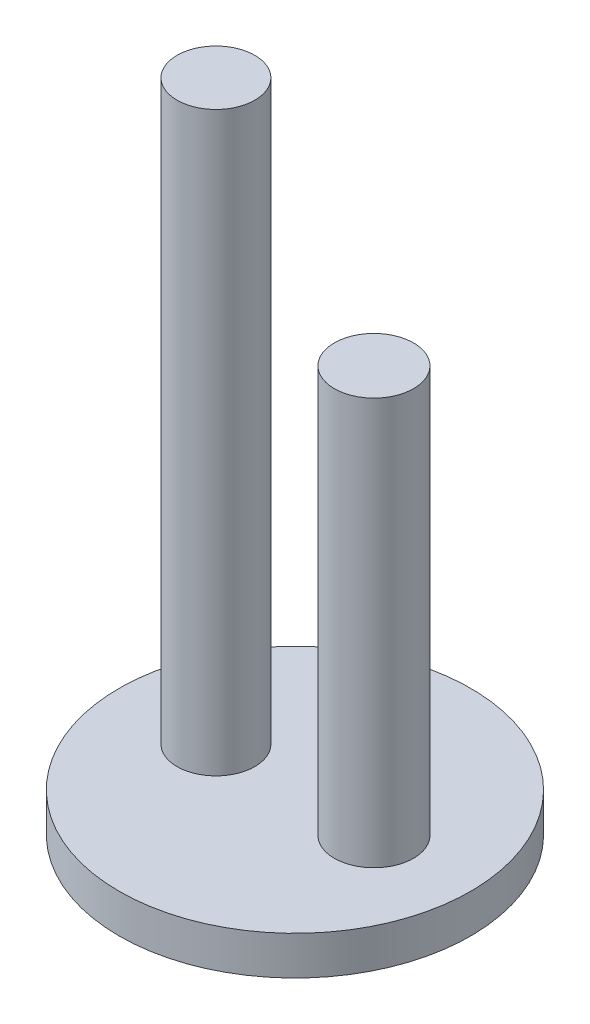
ISO-10303-21;
HEADER;
FILE_DESCRIPTION(('STEP AP214'),'2;1');
FILE_NAME('part.step','',(''),(''),'','','');
FILE_SCHEMA(('AUTOMOTIVE_DESIGN { 1 0 10303 214 1 1 1 1 }'));
ENDSEC;
DATA;
#1=APPLICATION_CONTEXT('core data for automotive mechanical design processes');
#2=APPLICATION_PROTOCOL_DEFINITION('international standard','automotive_design',2000,#1);
#3=PRODUCT_CONTEXT('',#1,'mechanical');
#4=PRODUCT('Part','Part','',(#3));
#5=PRODUCT_RELATED_PRODUCT_CATEGORY('part','',(#4));
#6=PRODUCT_DEFINITION_FORMATION('','',#4);
#7=PRODUCT_DEFINITION_CONTEXT('part definition',#1,'design');
#8=PRODUCT_DEFINITION('design','',#6,#7);
#9=PRODUCT_DEFINITION_SHAPE('','',#8);
#10=(LENGTH_UNIT() NAMED_UNIT(*) SI_UNIT(.MILLI.,.METRE.));
#11=(NAMED_UNIT(*) PLANE_ANGLE_UNIT() SI_UNIT($,.RADIAN.));
#12=(NAMED_UNIT(*) SI_UNIT($,.STERADIAN.) SOLID_ANGLE_UNIT());
#13=UNCERTAINTY_MEASURE_WITH_UNIT(LENGTH_MEASURE(1.E-05),#10,'distance_accuracy_value','');
#14=(GEOMETRIC_REPRESENTATION_CONTEXT(3) GLOBAL_UNCERTAINTY_ASSIGNED_CONTEXT((#13)) GLOBAL_UNIT_ASSIGNED_CONTEXT((#10,
#11,#12)) REPRESENTATION_CONTEXT('',''));
#15=CARTESIAN_POINT('',(0.,0.,0.));
#16=DIRECTION('',(0.,0.,1.));
#17=DIRECTION('',(1.,0.,0.));
#18=AXIS2_PLACEMENT_3D('',#15,#16,#17);
#19=CARTESIAN_POINT('',(0.,2.54,0.));
#20=DIRECTION('',(0.,1.,0.));
#21=DIRECTION('',(0.,0.,1.));
#22=AXIS2_PLACEMENT_3D('',#19,#20,#21);
#23=PLANE('',#22);
#24=CARTESIAN_POINT('',(-5.18043936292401,2.54,0.));
#25=DIRECTION('',(0.,1.,0.));
#26=DIRECTION('',(0.,0.,1.));
#27=AXIS2_PLACEMENT_3D('',#24,#25,#26);
#28=CIRCLE('',#27,2.55008613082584);
#29=CARTESIAN_POINT('',(-5.18043936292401,2.54,2.55008613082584));
#30=VERTEX_POINT('',#29);
#31=EDGE_CURVE('E46',#30,#30,#28,.T.);
#32=ORIENTED_EDGE('',*,*,#31,.F.);
#33=EDGE_LOOP('',(#32));
#34=FACE_BOUND('',#33,.T.);
#35=CARTESIAN_POINT('',(0.,2.54,0.));
#36=DIRECTION('',(0.,1.,0.));
#37=DIRECTION('',(0.,0.,1.));
#38=AXIS2_PLACEMENT_3D('',#35,#36,#37);
#39=CIRCLE('',#38,11.528213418);
#40=CARTESIAN_POINT('',(0.,2.54,11.528213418));
#41=VERTEX_POINT('',#40);
#42=EDGE_CURVE('E10',#41,#41,#39,.T.);
#43=ORIENTED_EDGE('',*,*,#42,.T.);
#44=EDGE_LOOP('',(#43));
#45=FACE_BOUND('',#44,.T.);
#46=CARTESIAN_POINT('',(5.18043936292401,2.54,0.));
#47=DIRECTION('',(0.,1.,0.));
#48=DIRECTION('',(0.,0.,1.));
#49=AXIS2_PLACEMENT_3D('',#46,#47,#48);
#50=CIRCLE('',#49,2.59930909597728);
#51=CARTESIAN_POINT('',(5.18043936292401,2.54,2.59930909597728));
#52=VERTEX_POINT('',#51);
#53=EDGE_CURVE('E52',#52,#52,#50,.T.);
#54=ORIENTED_EDGE('',*,*,#53,.F.);
#55=EDGE_LOOP('',(#54));
#56=FACE_BOUND('',#55,.T.);
#57=ADVANCED_FACE('F33',(#34,#45,#56),#23,.T.);
#58=CARTESIAN_POINT('',(0.,2.54,0.));
#59=DIRECTION('',(0.,-1.,0.));
#60=DIRECTION('',(0.,0.,-1.));
#61=AXIS2_PLACEMENT_3D('',#58,#59,#60);
#62=CYLINDRICAL_SURFACE('',#61,11.528213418);
#63=ORIENTED_EDGE('',*,*,#42,.F.);
#64=EDGE_LOOP('',(#63));
#65=FACE_BOUND('',#64,.T.);
#66=CARTESIAN_POINT('',(0.,0.,0.));
#67=DIRECTION('',(0.,1.,0.));
#68=DIRECTION('',(0.,0.,1.));
#69=AXIS2_PLACEMENT_3D('',#66,#67,#68);
#70=CIRCLE('',#69,11.528213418);
#71=CARTESIAN_POINT('',(0.,0.,11.528213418));
#72=VERTEX_POINT('',#71);
#73=EDGE_CURVE('E37',#72,#72,#70,.T.);
#74=ORIENTED_EDGE('',*,*,#73,.T.);
#75=EDGE_LOOP('',(#74));
#76=FACE_BOUND('',#75,.T.);
#77=ADVANCED_FACE('F35',(#65,#76),#62,.T.);
#78=CARTESIAN_POINT('',(0.,0.,0.));
#79=DIRECTION('',(0.,1.,0.));
#80=DIRECTION('',(0.,0.,1.));
#81=AXIS2_PLACEMENT_3D('',#78,#79,#80);
#82=PLANE('',#81);
#83=ORIENTED_EDGE('',*,*,#73,.F.);
#84=EDGE_LOOP('',(#83));
#85=FACE_BOUND('',#84,.T.);
#86=ADVANCED_FACE('F73',(#85),#82,.F.);
#87=CARTESIAN_POINT('',(-5.18043936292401,40.386,0.));
#88=DIRECTION('',(0.,-1.,0.));
#89=DIRECTION('',(0.,0.,-1.));
#90=AXIS2_PLACEMENT_3D('',#87,#88,#89);
#91=CYLINDRICAL_SURFACE('',#90,2.55008613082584);
#92=CARTESIAN_POINT('',(-5.18043936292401,40.386,0.));
#93=DIRECTION('',(0.,1.,0.));
#94=DIRECTION('',(0.,0.,1.));
#95=AXIS2_PLACEMENT_3D('',#92,#93,#94);
#96=CIRCLE('',#95,2.55008613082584);
#97=CARTESIAN_POINT('',(-5.18043936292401,40.386,2.55008613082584));
#98=VERTEX_POINT('',#97);
#99=EDGE_CURVE('E44',#98,#98,#96,.T.);
#100=ORIENTED_EDGE('',*,*,#99,.F.);
#101=EDGE_LOOP('',(#100));
#102=FACE_BOUND('',#101,.T.);
#103=ORIENTED_EDGE('',*,*,#31,.T.);
#104=EDGE_LOOP('',(#103));
#105=FACE_BOUND('',#104,.T.);
#106=ADVANCED_FACE('F77',(#102,#105),#91,.T.);
#107=CARTESIAN_POINT('',(-5.18043936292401,40.386,0.));
#108=DIRECTION('',(0.,1.,0.));
#109=DIRECTION('',(0.,0.,1.));
#110=AXIS2_PLACEMENT_3D('',#107,#108,#109);
#111=PLANE('',#110);
#112=ORIENTED_EDGE('',*,*,#99,.T.);
#113=EDGE_LOOP('',(#112));
#114=FACE_BOUND('',#113,.T.);
#115=ADVANCED_FACE('F63',(#114),#111,.T.);
#116=CARTESIAN_POINT('',(5.18043936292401,29.21,0.));
#117=DIRECTION('',(0.,-1.,0.));
#118=DIRECTION('',(0.,0.,-1.));
#119=AXIS2_PLACEMENT_3D('',#116,#117,#118);
#120=CYLINDRICAL_SURFACE('',#119,2.59930909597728);
#121=CARTESIAN_POINT('',(5.18043936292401,29.21,0.));
#122=DIRECTION('',(0.,1.,0.));
#123=DIRECTION('',(0.,0.,1.));
#124=AXIS2_PLACEMENT_3D('',#121,#122,#123);
#125=CIRCLE('',#124,2.59930909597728);
#126=CARTESIAN_POINT('',(5.18043936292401,29.21,2.59930909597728));
#127=VERTEX_POINT('',#126);
#128=EDGE_CURVE('E49',#127,#127,#125,.T.);
#129=ORIENTED_EDGE('',*,*,#128,.F.);
#130=EDGE_LOOP('',(#129));
#131=FACE_BOUND('',#130,.T.);
#132=ORIENTED_EDGE('',*,*,#53,.T.);
#133=EDGE_LOOP('',(#132));
#134=FACE_BOUND('',#133,.T.);
#135=ADVANCED_FACE('F60',(#131,#134),#120,.T.);
#136=CARTESIAN_POINT('',(-25.5034908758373,29.21,0.));
#137=DIRECTION('',(0.,1.,0.));
#138=DIRECTION('',(0.,0.,1.));
#139=AXIS2_PLACEMENT_3D('',#136,#137,#138);
#140=PLANE('',#139);
#141=ORIENTED_EDGE('',*,*,#128,.T.);
#142=EDGE_LOOP('',(#141));
#143=FACE_BOUND('',#142,.T.);
#144=ADVANCED_FACE('F58',(#143),#140,.T.);
#145=CLOSED_SHELL('',(#57,#77,#86,#106,#115,#135,#144));
#146=MANIFOLD_SOLID_BREP('B2',#145);
#147=ADVANCED_BREP_SHAPE_REPRESENTATION('',(#18,#146),#14);
#148=SHAPE_DEFINITION_REPRESENTATION(#9,#147);
ENDSEC;
END-ISO-10303-21;
